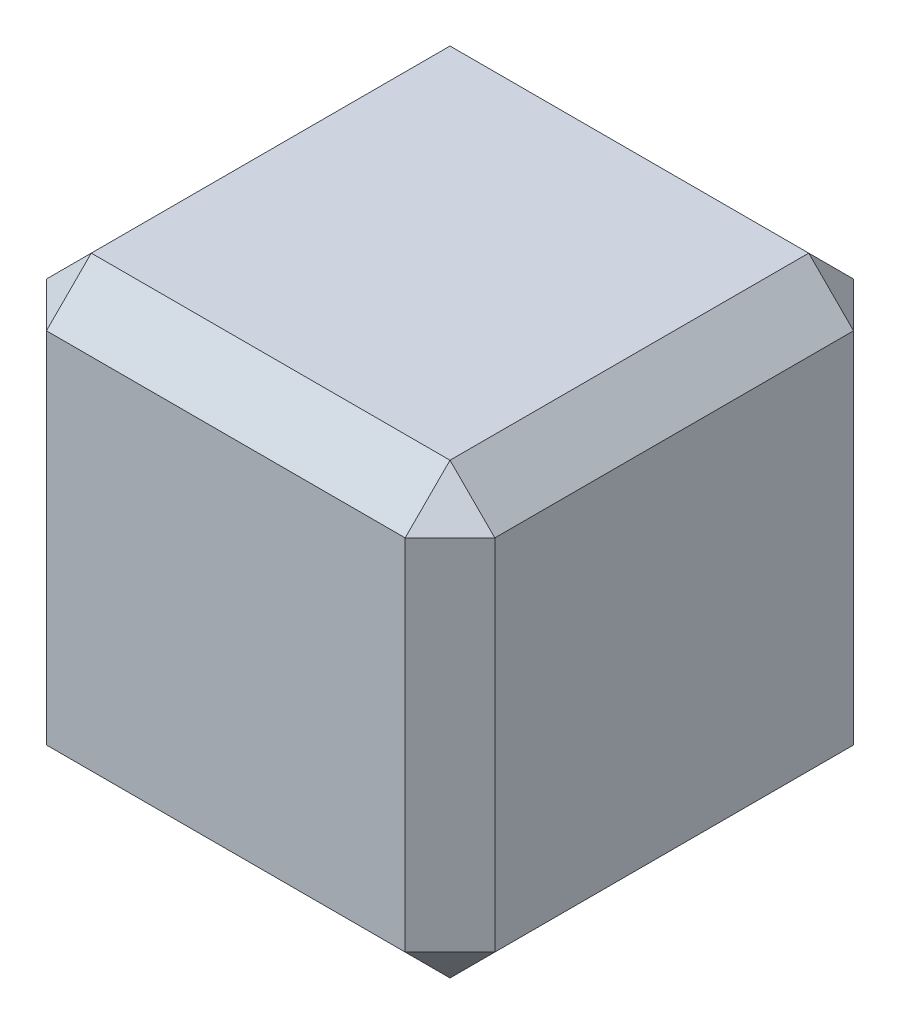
ISO-10303-21;
HEADER;
FILE_DESCRIPTION(('STEP AP214'),'2;1');
FILE_NAME('part.step','',(''),(''),'','','');
FILE_SCHEMA(('AUTOMOTIVE_DESIGN { 1 0 10303 214 1 1 1 1 }'));
ENDSEC;
DATA;
#1=APPLICATION_CONTEXT('core data for automotive mechanical design processes');
#2=APPLICATION_PROTOCOL_DEFINITION('international standard','automotive_design',2000,#1);
#3=PRODUCT_CONTEXT('',#1,'mechanical');
#4=PRODUCT('Part','Part','',(#3));
#5=PRODUCT_RELATED_PRODUCT_CATEGORY('part','',(#4));
#6=PRODUCT_DEFINITION_FORMATION('','',#4);
#7=PRODUCT_DEFINITION_CONTEXT('part definition',#1,'design');
#8=PRODUCT_DEFINITION('design','',#6,#7);
#9=PRODUCT_DEFINITION_SHAPE('','',#8);
#10=(LENGTH_UNIT() NAMED_UNIT(*) SI_UNIT(.MILLI.,.METRE.));
#11=(NAMED_UNIT(*) PLANE_ANGLE_UNIT() SI_UNIT($,.RADIAN.));
#12=(NAMED_UNIT(*) SI_UNIT($,.STERADIAN.) SOLID_ANGLE_UNIT());
#13=UNCERTAINTY_MEASURE_WITH_UNIT(LENGTH_MEASURE(1.E-05),#10,'distance_accuracy_value','');
#14=(GEOMETRIC_REPRESENTATION_CONTEXT(3) GLOBAL_UNCERTAINTY_ASSIGNED_CONTEXT((#13)) GLOBAL_UNIT_ASSIGNED_CONTEXT((#10,
#11,#12)) REPRESENTATION_CONTEXT('',''));
#15=CARTESIAN_POINT('',(0.,0.,0.));
#16=DIRECTION('',(0.,0.,1.));
#17=DIRECTION('',(1.,0.,0.));
#18=AXIS2_PLACEMENT_3D('',#15,#16,#17);
#19=CARTESIAN_POINT('',(0.,0.,10.));
#20=DIRECTION('',(1.,0.,0.));
#21=DIRECTION('',(0.,0.,-1.));
#22=AXIS2_PLACEMENT_3D('',#19,#20,#21);
#23=PLANE('',#22);
#24=DIRECTION('',(0.,0.,1.));
#25=VECTOR('',#24,1.);
#26=CARTESIAN_POINT('',(0.,0.999999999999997,10.));
#27=LINE('',#26,#25);
#28=CARTESIAN_POINT('',(0.,0.999999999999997,0.999999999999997));
#29=VERTEX_POINT('',#28);
#30=CARTESIAN_POINT('',(0.,0.999999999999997,9.));
#31=VERTEX_POINT('',#30);
#32=EDGE_CURVE('E179',#29,#31,#27,.T.);
#33=ORIENTED_EDGE('',*,*,#32,.T.);
#34=DIRECTION('',(0.,1.,0.));
#35=VECTOR('',#34,1.);
#36=CARTESIAN_POINT('',(0.,0.,9.));
#37=LINE('',#36,#35);
#38=CARTESIAN_POINT('',(0.,9.,9.));
#39=VERTEX_POINT('',#38);
#40=EDGE_CURVE('E143',#31,#39,#37,.T.);
#41=ORIENTED_EDGE('',*,*,#40,.T.);
#42=DIRECTION('',(0.,0.,-1.));
#43=VECTOR('',#42,1.);
#44=CARTESIAN_POINT('',(0.,9.,10.));
#45=LINE('',#44,#43);
#46=CARTESIAN_POINT('',(0.,9.,0.999999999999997));
#47=VERTEX_POINT('',#46);
#48=EDGE_CURVE('E181',#39,#47,#45,.T.);
#49=ORIENTED_EDGE('',*,*,#48,.T.);
#50=DIRECTION('',(0.,-1.,0.));
#51=VECTOR('',#50,1.);
#52=CARTESIAN_POINT('',(0.,0.,0.999999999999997));
#53=LINE('',#52,#51);
#54=EDGE_CURVE('E177',#47,#29,#53,.T.);
#55=ORIENTED_EDGE('',*,*,#54,.T.);
#56=EDGE_LOOP('',(#33,#41,#49,#55));
#57=FACE_BOUND('',#56,.T.);
#58=ADVANCED_FACE('F35',(#57),#23,.F.);
#59=CARTESIAN_POINT('',(0.,0.,10.));
#60=DIRECTION('',(0.,1.,0.));
#61=DIRECTION('',(0.,0.,1.));
#62=AXIS2_PLACEMENT_3D('',#59,#60,#61);
#63=PLANE('',#62);
#64=DIRECTION('',(-1.,0.,0.));
#65=VECTOR('',#64,1.);
#66=CARTESIAN_POINT('',(0.,0.,9.));
#67=LINE('',#66,#65);
#68=CARTESIAN_POINT('',(9.,0.,9.));
#69=VERTEX_POINT('',#68);
#70=CARTESIAN_POINT('',(1.,0.,9.));
#71=VERTEX_POINT('',#70);
#72=EDGE_CURVE('E197',#69,#71,#67,.T.);
#73=ORIENTED_EDGE('',*,*,#72,.T.);
#74=DIRECTION('',(0.,0.,-1.));
#75=VECTOR('',#74,1.);
#76=CARTESIAN_POINT('',(1.,0.,10.));
#77=LINE('',#76,#75);
#78=CARTESIAN_POINT('',(1.,0.,0.999999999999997));
#79=VERTEX_POINT('',#78);
#80=EDGE_CURVE('E199',#71,#79,#77,.T.);
#81=ORIENTED_EDGE('',*,*,#80,.T.);
#82=DIRECTION('',(1.,0.,0.));
#83=VECTOR('',#82,1.);
#84=CARTESIAN_POINT('',(10.,0.,0.999999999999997));
#85=LINE('',#84,#83);
#86=CARTESIAN_POINT('',(9.,0.,0.999999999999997));
#87=VERTEX_POINT('',#86);
#88=EDGE_CURVE('E193',#79,#87,#85,.T.);
#89=ORIENTED_EDGE('',*,*,#88,.T.);
#90=DIRECTION('',(0.,0.,1.));
#91=VECTOR('',#90,1.);
#92=CARTESIAN_POINT('',(9.,0.,10.));
#93=LINE('',#92,#91);
#94=EDGE_CURVE('E195',#87,#69,#93,.T.);
#95=ORIENTED_EDGE('',*,*,#94,.T.);
#96=EDGE_LOOP('',(#73,#81,#89,#95));
#97=FACE_BOUND('',#96,.T.);
#98=ADVANCED_FACE('F303',(#97),#63,.F.);
#99=CARTESIAN_POINT('',(10.,0.,10.));
#100=DIRECTION('',(-1.,0.,0.));
#101=DIRECTION('',(0.,0.,1.));
#102=AXIS2_PLACEMENT_3D('',#99,#100,#101);
#103=PLANE('',#102);
#104=DIRECTION('',(0.,0.,1.));
#105=VECTOR('',#104,1.);
#106=CARTESIAN_POINT('',(10.,9.,10.));
#107=LINE('',#106,#105);
#108=CARTESIAN_POINT('',(10.,9.,0.999999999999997));
#109=VERTEX_POINT('',#108);
#110=CARTESIAN_POINT('',(10.,9.,9.));
#111=VERTEX_POINT('',#110);
#112=EDGE_CURVE('E172',#109,#111,#107,.T.);
#113=ORIENTED_EDGE('',*,*,#112,.T.);
#114=DIRECTION('',(0.,-1.,0.));
#115=VECTOR('',#114,1.);
#116=CARTESIAN_POINT('',(10.,0.,9.));
#117=LINE('',#116,#115);
#118=CARTESIAN_POINT('',(10.,0.999999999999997,9.));
#119=VERTEX_POINT('',#118);
#120=EDGE_CURVE('E174',#111,#119,#117,.T.);
#121=ORIENTED_EDGE('',*,*,#120,.T.);
#122=DIRECTION('',(0.,0.,-1.));
#123=VECTOR('',#122,1.);
#124=CARTESIAN_POINT('',(10.,0.999999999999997,10.));
#125=LINE('',#124,#123);
#126=CARTESIAN_POINT('',(10.,0.999999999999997,0.999999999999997));
#127=VERTEX_POINT('',#126);
#128=EDGE_CURVE('E170',#119,#127,#125,.T.);
#129=ORIENTED_EDGE('',*,*,#128,.T.);
#130=DIRECTION('',(0.,1.,0.));
#131=VECTOR('',#130,1.);
#132=CARTESIAN_POINT('',(10.,10.,0.999999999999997));
#133=LINE('',#132,#131);
#134=EDGE_CURVE('E168',#127,#109,#133,.T.);
#135=ORIENTED_EDGE('',*,*,#134,.T.);
#136=EDGE_LOOP('',(#113,#121,#129,#135));
#137=FACE_BOUND('',#136,.T.);
#138=ADVANCED_FACE('F308',(#137),#103,.F.);
#139=CARTESIAN_POINT('',(0.,10.,10.));
#140=DIRECTION('',(0.,-1.,0.));
#141=DIRECTION('',(0.,0.,-1.));
#142=AXIS2_PLACEMENT_3D('',#139,#140,#141);
#143=PLANE('',#142);
#144=DIRECTION('',(1.,0.,0.));
#145=VECTOR('',#144,1.);
#146=CARTESIAN_POINT('',(0.,10.,9.));
#147=LINE('',#146,#145);
#148=CARTESIAN_POINT('',(1.,10.,9.));
#149=VERTEX_POINT('',#148);
#150=CARTESIAN_POINT('',(9.,10.,9.));
#151=VERTEX_POINT('',#150);
#152=EDGE_CURVE('E188',#149,#151,#147,.T.);
#153=ORIENTED_EDGE('',*,*,#152,.T.);
#154=DIRECTION('',(0.,0.,-1.));
#155=VECTOR('',#154,1.);
#156=CARTESIAN_POINT('',(9.,10.,10.));
#157=LINE('',#156,#155);
#158=CARTESIAN_POINT('',(9.,10.,0.999999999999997));
#159=VERTEX_POINT('',#158);
#160=EDGE_CURVE('E190',#151,#159,#157,.T.);
#161=ORIENTED_EDGE('',*,*,#160,.T.);
#162=DIRECTION('',(-1.,0.,0.));
#163=VECTOR('',#162,1.);
#164=CARTESIAN_POINT('',(0.,10.,0.999999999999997));
#165=LINE('',#164,#163);
#166=CARTESIAN_POINT('',(1.,10.,0.999999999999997));
#167=VERTEX_POINT('',#166);
#168=EDGE_CURVE('E184',#159,#167,#165,.T.);
#169=ORIENTED_EDGE('',*,*,#168,.T.);
#170=DIRECTION('',(0.,0.,1.));
#171=VECTOR('',#170,1.);
#172=CARTESIAN_POINT('',(1.,10.,10.));
#173=LINE('',#172,#171);
#174=EDGE_CURVE('E186',#167,#149,#173,.T.);
#175=ORIENTED_EDGE('',*,*,#174,.T.);
#176=EDGE_LOOP('',(#153,#161,#169,#175));
#177=FACE_BOUND('',#176,.T.);
#178=ADVANCED_FACE('F268',(#177),#143,.F.);
#179=CARTESIAN_POINT('',(0.,0.,10.));
#180=DIRECTION('',(0.,0.,-1.));
#181=DIRECTION('',(-1.,0.,0.));
#182=AXIS2_PLACEMENT_3D('',#179,#180,#181);
#183=PLANE('',#182);
#184=DIRECTION('',(0.,1.,0.));
#185=VECTOR('',#184,1.);
#186=CARTESIAN_POINT('',(9.,0.,10.));
#187=LINE('',#186,#185);
#188=CARTESIAN_POINT('',(9.,0.999999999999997,10.));
#189=VERTEX_POINT('',#188);
#190=CARTESIAN_POINT('',(9.,9.,10.));
#191=VERTEX_POINT('',#190);
#192=EDGE_CURVE('E135',#189,#191,#187,.T.);
#193=ORIENTED_EDGE('',*,*,#192,.T.);
#194=DIRECTION('',(-1.,0.,0.));
#195=VECTOR('',#194,1.);
#196=CARTESIAN_POINT('',(0.,9.,10.));
#197=LINE('',#196,#195);
#198=CARTESIAN_POINT('',(1.,9.,10.));
#199=VERTEX_POINT('',#198);
#200=EDGE_CURVE('E131',#191,#199,#197,.T.);
#201=ORIENTED_EDGE('',*,*,#200,.T.);
#202=DIRECTION('',(0.,-1.,0.));
#203=VECTOR('',#202,1.);
#204=CARTESIAN_POINT('',(1.,0.,10.));
#205=LINE('',#204,#203);
#206=CARTESIAN_POINT('',(1.,0.999999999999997,10.));
#207=VERTEX_POINT('',#206);
#208=EDGE_CURVE('E123',#199,#207,#205,.T.);
#209=ORIENTED_EDGE('',*,*,#208,.T.);
#210=DIRECTION('',(1.,0.,0.));
#211=VECTOR('',#210,1.);
#212=CARTESIAN_POINT('',(0.,0.999999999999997,10.));
#213=LINE('',#212,#211);
#214=EDGE_CURVE('E128',#207,#189,#213,.T.);
#215=ORIENTED_EDGE('',*,*,#214,.T.);
#216=EDGE_LOOP('',(#193,#201,#209,#215));
#217=FACE_BOUND('',#216,.T.);
#218=ADVANCED_FACE('F126',(#217),#183,.F.);
#219=CARTESIAN_POINT('',(0.,0.,0.));
#220=DIRECTION('',(0.,0.,-1.));
#221=DIRECTION('',(-1.,0.,0.));
#222=AXIS2_PLACEMENT_3D('',#219,#220,#221);
#223=PLANE('',#222);
#224=DIRECTION('',(0.,-1.,0.));
#225=VECTOR('',#224,1.);
#226=CARTESIAN_POINT('',(9.,0.,0.));
#227=LINE('',#226,#225);
#228=CARTESIAN_POINT('',(9.,9.,0.));
#229=VERTEX_POINT('',#228);
#230=CARTESIAN_POINT('',(9.,1.,0.));
#231=VERTEX_POINT('',#230);
#232=EDGE_CURVE('E45',#229,#231,#227,.T.);
#233=ORIENTED_EDGE('',*,*,#232,.T.);
#234=DIRECTION('',(-1.,0.,0.));
#235=VECTOR('',#234,1.);
#236=CARTESIAN_POINT('',(0.,1.,0.));
#237=LINE('',#236,#235);
#238=CARTESIAN_POINT('',(1.,1.,0.));
#239=VERTEX_POINT('',#238);
#240=EDGE_CURVE('E11',#231,#239,#237,.T.);
#241=ORIENTED_EDGE('',*,*,#240,.T.);
#242=DIRECTION('',(0.,1.,0.));
#243=VECTOR('',#242,1.);
#244=CARTESIAN_POINT('',(1.,10.,0.));
#245=LINE('',#244,#243);
#246=CARTESIAN_POINT('',(1.,9.,0.));
#247=VERTEX_POINT('',#246);
#248=EDGE_CURVE('E202',#239,#247,#245,.T.);
#249=ORIENTED_EDGE('',*,*,#248,.T.);
#250=DIRECTION('',(1.,0.,0.));
#251=VECTOR('',#250,1.);
#252=CARTESIAN_POINT('',(10.,9.,0.));
#253=LINE('',#252,#251);
#254=EDGE_CURVE('E56',#247,#229,#253,.T.);
#255=ORIENTED_EDGE('',*,*,#254,.T.);
#256=EDGE_LOOP('',(#233,#241,#249,#255));
#257=FACE_BOUND('',#256,.T.);
#258=ADVANCED_FACE('F292',(#257),#223,.T.);
#259=CARTESIAN_POINT('',(0.,0.,0.999999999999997));
#260=DIRECTION('',(-0.707106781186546,0.,-0.707106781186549));
#261=DIRECTION('',(0.,1.,0.));
#262=AXIS2_PLACEMENT_3D('',#259,#260,#261);
#263=PLANE('',#262);
#264=DIRECTION('',(0.707106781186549,0.,-0.707106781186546));
#265=VECTOR('',#264,1.);
#266=CARTESIAN_POINT('',(0.5,1.,0.499999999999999));
#267=LINE('',#266,#265);
#268=EDGE_CURVE('E40',#29,#239,#267,.T.);
#269=ORIENTED_EDGE('',*,*,#268,.F.);
#270=ORIENTED_EDGE('',*,*,#54,.F.);
#271=DIRECTION('',(-0.707106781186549,0.,0.707106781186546));
#272=VECTOR('',#271,1.);
#273=CARTESIAN_POINT('',(0.,9.,0.999999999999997));
#274=LINE('',#273,#272);
#275=EDGE_CURVE('E164',#247,#47,#274,.T.);
#276=ORIENTED_EDGE('',*,*,#275,.F.);
#277=ORIENTED_EDGE('',*,*,#248,.F.);
#278=EDGE_LOOP('',(#269,#270,#276,#277));
#279=FACE_BOUND('',#278,.T.);
#280=ADVANCED_FACE('F38',(#279),#263,.T.);
#281=CARTESIAN_POINT('',(1.,0.,0.999999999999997));
#282=DIRECTION('',(-0.577350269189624,-0.577350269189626,-0.577350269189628));
#283=DIRECTION('',(0.,0.707106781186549,-0.707106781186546));
#284=AXIS2_PLACEMENT_3D('',#281,#282,#283);
#285=PLANE('',#284);
#286=DIRECTION('',(0.707106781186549,-0.707106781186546,0.));
#287=VECTOR('',#286,1.);
#288=CARTESIAN_POINT('',(1.,0.,0.999999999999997));
#289=LINE('',#288,#287);
#290=EDGE_CURVE('E248',#29,#79,#289,.T.);
#291=ORIENTED_EDGE('',*,*,#290,.F.);
#292=ORIENTED_EDGE('',*,*,#268,.T.);
#293=DIRECTION('',(0.,-0.707106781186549,0.707106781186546));
#294=VECTOR('',#293,1.);
#295=CARTESIAN_POINT('',(1.,0.,0.999999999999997));
#296=LINE('',#295,#294);
#297=EDGE_CURVE('E251',#79,#239,#296,.F.);
#298=ORIENTED_EDGE('',*,*,#297,.F.);
#299=EDGE_LOOP('',(#291,#292,#298));
#300=FACE_BOUND('',#299,.T.);
#301=ADVANCED_FACE('F297',(#300),#285,.T.);
#302=CARTESIAN_POINT('',(0.,9.,0.999999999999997));
#303=DIRECTION('',(-0.577350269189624,0.577350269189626,-0.577350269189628));
#304=DIRECTION('',(0.,0.707106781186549,0.707106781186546));
#305=AXIS2_PLACEMENT_3D('',#302,#303,#304);
#306=PLANE('',#305);
#307=DIRECTION('',(0.,-0.707106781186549,-0.707106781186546));
#308=VECTOR('',#307,1.);
#309=CARTESIAN_POINT('',(1.,9.5,0.499999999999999));
#310=LINE('',#309,#308);
#311=EDGE_CURVE('E242',#247,#167,#310,.F.);
#312=ORIENTED_EDGE('',*,*,#311,.F.);
#313=ORIENTED_EDGE('',*,*,#275,.T.);
#314=DIRECTION('',(-0.707106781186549,-0.707106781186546,0.));
#315=VECTOR('',#314,1.);
#316=CARTESIAN_POINT('',(0.,9.,0.999999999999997));
#317=LINE('',#316,#315);
#318=EDGE_CURVE('E245',#167,#47,#317,.T.);
#319=ORIENTED_EDGE('',*,*,#318,.F.);
#320=EDGE_LOOP('',(#312,#313,#319));
#321=FACE_BOUND('',#320,.T.);
#322=ADVANCED_FACE('F257',(#321),#306,.T.);
#323=CARTESIAN_POINT('',(0.,0.,0.999999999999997));
#324=DIRECTION('',(0.,-0.707106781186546,-0.707106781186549));
#325=DIRECTION('',(-1.,0.,0.));
#326=AXIS2_PLACEMENT_3D('',#323,#324,#325);
#327=PLANE('',#326);
#328=ORIENTED_EDGE('',*,*,#297,.T.);
#329=ORIENTED_EDGE('',*,*,#240,.F.);
#330=DIRECTION('',(0.,0.707106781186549,-0.707106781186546));
#331=VECTOR('',#330,1.);
#332=CARTESIAN_POINT('',(9.,0.500000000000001,0.499999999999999));
#333=LINE('',#332,#331);
#334=EDGE_CURVE('E236',#87,#231,#333,.T.);
#335=ORIENTED_EDGE('',*,*,#334,.F.);
#336=ORIENTED_EDGE('',*,*,#88,.F.);
#337=EDGE_LOOP('',(#328,#329,#335,#336));
#338=FACE_BOUND('',#337,.T.);
#339=ADVANCED_FACE('F290',(#338),#327,.T.);
#340=CARTESIAN_POINT('',(1.,0.,10.));
#341=DIRECTION('',(0.707106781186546,0.707106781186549,0.));
#342=DIRECTION('',(0.,0.,-1.));
#343=AXIS2_PLACEMENT_3D('',#340,#341,#342);
#344=PLANE('',#343);
#345=ORIENTED_EDGE('',*,*,#290,.T.);
#346=ORIENTED_EDGE('',*,*,#80,.F.);
#347=DIRECTION('',(-0.707106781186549,0.707106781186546,0.));
#348=VECTOR('',#347,1.);
#349=CARTESIAN_POINT('',(0.5,0.499999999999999,9.));
#350=LINE('',#349,#348);
#351=EDGE_CURVE('E147',#31,#71,#350,.F.);
#352=ORIENTED_EDGE('',*,*,#351,.F.);
#353=ORIENTED_EDGE('',*,*,#32,.F.);
#354=EDGE_LOOP('',(#345,#346,#352,#353));
#355=FACE_BOUND('',#354,.T.);
#356=ADVANCED_FACE('F300',(#355),#344,.F.);
#357=CARTESIAN_POINT('',(1.,0.,10.));
#358=DIRECTION('',(0.707106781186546,0.,-0.707106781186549));
#359=DIRECTION('',(0.,-1.,0.));
#360=AXIS2_PLACEMENT_3D('',#357,#358,#359);
#361=PLANE('',#360);
#362=DIRECTION('',(-0.707106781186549,0.,-0.707106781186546));
#363=VECTOR('',#362,1.);
#364=CARTESIAN_POINT('',(0.,9.,9.));
#365=LINE('',#364,#363);
#366=EDGE_CURVE('E148',#39,#199,#365,.F.);
#367=ORIENTED_EDGE('',*,*,#366,.F.);
#368=ORIENTED_EDGE('',*,*,#40,.F.);
#369=DIRECTION('',(0.707106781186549,0.,0.707106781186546));
#370=VECTOR('',#369,1.);
#371=CARTESIAN_POINT('',(1.,0.999999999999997,10.));
#372=LINE('',#371,#370);
#373=EDGE_CURVE('E139',#207,#31,#372,.F.);
#374=ORIENTED_EDGE('',*,*,#373,.F.);
#375=ORIENTED_EDGE('',*,*,#208,.F.);
#376=EDGE_LOOP('',(#367,#368,#374,#375));
#377=FACE_BOUND('',#376,.T.);
#378=ADVANCED_FACE('F141',(#377),#361,.F.);
#379=CARTESIAN_POINT('',(0.,9.,10.));
#380=DIRECTION('',(0.707106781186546,-0.707106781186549,0.));
#381=DIRECTION('',(0.,0.,-1.));
#382=AXIS2_PLACEMENT_3D('',#379,#380,#381);
#383=PLANE('',#382);
#384=ORIENTED_EDGE('',*,*,#318,.T.);
#385=ORIENTED_EDGE('',*,*,#48,.F.);
#386=DIRECTION('',(0.707106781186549,0.707106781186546,0.));
#387=VECTOR('',#386,1.);
#388=CARTESIAN_POINT('',(0.,9.,9.));
#389=LINE('',#388,#387);
#390=EDGE_CURVE('E232',#149,#39,#389,.F.);
#391=ORIENTED_EDGE('',*,*,#390,.F.);
#392=ORIENTED_EDGE('',*,*,#174,.F.);
#393=EDGE_LOOP('',(#384,#385,#391,#392));
#394=FACE_BOUND('',#393,.T.);
#395=ADVANCED_FACE('F264',(#394),#383,.F.);
#396=CARTESIAN_POINT('',(0.,10.,0.999999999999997));
#397=DIRECTION('',(0.,0.707106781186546,-0.707106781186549));
#398=DIRECTION('',(1.,0.,0.));
#399=AXIS2_PLACEMENT_3D('',#396,#397,#398);
#400=PLANE('',#399);
#401=ORIENTED_EDGE('',*,*,#311,.T.);
#402=ORIENTED_EDGE('',*,*,#168,.F.);
#403=DIRECTION('',(0.,0.707106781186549,0.707106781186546));
#404=VECTOR('',#403,1.);
#405=CARTESIAN_POINT('',(9.,10.,0.999999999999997));
#406=LINE('',#405,#404);
#407=EDGE_CURVE('E229',#229,#159,#406,.T.);
#408=ORIENTED_EDGE('',*,*,#407,.F.);
#409=ORIENTED_EDGE('',*,*,#254,.F.);
#410=EDGE_LOOP('',(#401,#402,#408,#409));
#411=FACE_BOUND('',#410,.T.);
#412=ADVANCED_FACE('F274',(#411),#400,.T.);
#413=CARTESIAN_POINT('',(10.,0.,0.999999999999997));
#414=DIRECTION('',(0.707106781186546,0.,-0.707106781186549));
#415=DIRECTION('',(0.,-1.,0.));
#416=AXIS2_PLACEMENT_3D('',#413,#414,#415);
#417=PLANE('',#416);
#418=DIRECTION('',(0.707106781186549,0.,0.707106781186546));
#419=VECTOR('',#418,1.);
#420=CARTESIAN_POINT('',(10.,0.999999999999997,0.999999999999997));
#421=LINE('',#420,#419);
#422=EDGE_CURVE('E239',#231,#127,#421,.T.);
#423=ORIENTED_EDGE('',*,*,#422,.F.);
#424=ORIENTED_EDGE('',*,*,#232,.F.);
#425=DIRECTION('',(-0.707106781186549,0.,-0.707106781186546));
#426=VECTOR('',#425,1.);
#427=CARTESIAN_POINT('',(9.5,9.,0.499999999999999));
#428=LINE('',#427,#426);
#429=EDGE_CURVE('E226',#109,#229,#428,.T.);
#430=ORIENTED_EDGE('',*,*,#429,.F.);
#431=ORIENTED_EDGE('',*,*,#134,.F.);
#432=EDGE_LOOP('',(#423,#424,#430,#431));
#433=FACE_BOUND('',#432,.T.);
#434=ADVANCED_FACE('F283',(#433),#417,.T.);
#435=CARTESIAN_POINT('',(10.,0.999999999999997,0.999999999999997));
#436=DIRECTION('',(0.577350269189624,-0.577350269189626,-0.577350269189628));
#437=DIRECTION('',(0.,0.707106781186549,-0.707106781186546));
#438=AXIS2_PLACEMENT_3D('',#435,#436,#437);
#439=PLANE('',#438);
#440=ORIENTED_EDGE('',*,*,#334,.T.);
#441=ORIENTED_EDGE('',*,*,#422,.T.);
#442=DIRECTION('',(0.707106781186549,0.707106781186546,0.));
#443=VECTOR('',#442,1.);
#444=CARTESIAN_POINT('',(10.,0.999999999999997,0.999999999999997));
#445=LINE('',#444,#443);
#446=EDGE_CURVE('E155',#87,#127,#445,.T.);
#447=ORIENTED_EDGE('',*,*,#446,.F.);
#448=EDGE_LOOP('',(#440,#441,#447));
#449=FACE_BOUND('',#448,.T.);
#450=ADVANCED_FACE('F287',(#449),#439,.T.);
#451=CARTESIAN_POINT('',(1.,0.999999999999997,10.));
#452=DIRECTION('',(-0.577350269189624,-0.577350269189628,0.577350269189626));
#453=DIRECTION('',(0.,-0.707106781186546,-0.707106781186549));
#454=AXIS2_PLACEMENT_3D('',#451,#452,#453);
#455=PLANE('',#454);
#456=ORIENTED_EDGE('',*,*,#373,.T.);
#457=ORIENTED_EDGE('',*,*,#351,.T.);
#458=DIRECTION('',(0.,-0.707106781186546,-0.707106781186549));
#459=VECTOR('',#458,1.);
#460=CARTESIAN_POINT('',(1.,0.999999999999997,10.));
#461=LINE('',#460,#459);
#462=EDGE_CURVE('E151',#207,#71,#461,.T.);
#463=ORIENTED_EDGE('',*,*,#462,.F.);
#464=EDGE_LOOP('',(#456,#457,#463));
#465=FACE_BOUND('',#464,.T.);
#466=ADVANCED_FACE('F152',(#465),#455,.T.);
#467=CARTESIAN_POINT('',(0.,9.,9.));
#468=DIRECTION('',(-0.577350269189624,0.577350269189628,0.577350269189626));
#469=DIRECTION('',(0.,-0.707106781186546,0.707106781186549));
#470=AXIS2_PLACEMENT_3D('',#467,#468,#469);
#471=PLANE('',#470);
#472=ORIENTED_EDGE('',*,*,#390,.T.);
#473=ORIENTED_EDGE('',*,*,#366,.T.);
#474=DIRECTION('',(0.,-0.707106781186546,0.707106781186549));
#475=VECTOR('',#474,1.);
#476=CARTESIAN_POINT('',(1.,9.5,9.5));
#477=LINE('',#476,#475);
#478=EDGE_CURVE('E156',#149,#199,#477,.T.);
#479=ORIENTED_EDGE('',*,*,#478,.F.);
#480=EDGE_LOOP('',(#472,#473,#479));
#481=FACE_BOUND('',#480,.T.);
#482=ADVANCED_FACE('F366',(#481),#471,.T.);
#483=CARTESIAN_POINT('',(9.,10.,0.999999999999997));
#484=DIRECTION('',(0.577350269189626,0.577350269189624,-0.577350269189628));
#485=DIRECTION('',(-0.707106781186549,0.,-0.707106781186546));
#486=AXIS2_PLACEMENT_3D('',#483,#484,#485);
#487=PLANE('',#486);
#488=ORIENTED_EDGE('',*,*,#429,.T.);
#489=ORIENTED_EDGE('',*,*,#407,.T.);
#490=DIRECTION('',(-0.707106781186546,0.707106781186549,0.));
#491=VECTOR('',#490,1.);
#492=CARTESIAN_POINT('',(9.,10.,0.999999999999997));
#493=LINE('',#492,#491);
#494=EDGE_CURVE('E220',#109,#159,#493,.T.);
#495=ORIENTED_EDGE('',*,*,#494,.F.);
#496=EDGE_LOOP('',(#488,#489,#495));
#497=FACE_BOUND('',#496,.T.);
#498=ADVANCED_FACE('F278',(#497),#487,.T.);
#499=CARTESIAN_POINT('',(10.,0.999999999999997,10.));
#500=DIRECTION('',(-0.707106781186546,0.707106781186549,0.));
#501=DIRECTION('',(0.,0.,-1.));
#502=AXIS2_PLACEMENT_3D('',#499,#500,#501);
#503=PLANE('',#502);
#504=ORIENTED_EDGE('',*,*,#446,.T.);
#505=ORIENTED_EDGE('',*,*,#128,.F.);
#506=DIRECTION('',(-0.707106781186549,-0.707106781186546,0.));
#507=VECTOR('',#506,1.);
#508=CARTESIAN_POINT('',(10.,0.999999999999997,9.));
#509=LINE('',#508,#507);
#510=EDGE_CURVE('E217',#69,#119,#509,.F.);
#511=ORIENTED_EDGE('',*,*,#510,.F.);
#512=ORIENTED_EDGE('',*,*,#94,.F.);
#513=EDGE_LOOP('',(#504,#505,#511,#512));
#514=FACE_BOUND('',#513,.T.);
#515=ADVANCED_FACE('F354',(#514),#503,.F.);
#516=CARTESIAN_POINT('',(0.,0.999999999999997,10.));
#517=DIRECTION('',(0.,0.707106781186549,-0.707106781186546));
#518=DIRECTION('',(1.,0.,0.));
#519=AXIS2_PLACEMENT_3D('',#516,#517,#518);
#520=PLANE('',#519);
#521=ORIENTED_EDGE('',*,*,#462,.T.);
#522=ORIENTED_EDGE('',*,*,#72,.F.);
#523=DIRECTION('',(0.,0.707106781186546,0.707106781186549));
#524=VECTOR('',#523,1.);
#525=CARTESIAN_POINT('',(9.,0.499999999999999,9.5));
#526=LINE('',#525,#524);
#527=EDGE_CURVE('E160',#189,#69,#526,.F.);
#528=ORIENTED_EDGE('',*,*,#527,.F.);
#529=ORIENTED_EDGE('',*,*,#214,.F.);
#530=EDGE_LOOP('',(#521,#522,#528,#529));
#531=FACE_BOUND('',#530,.T.);
#532=ADVANCED_FACE('F158',(#531),#520,.F.);
#533=CARTESIAN_POINT('',(0.,9.,10.));
#534=DIRECTION('',(0.,-0.707106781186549,-0.707106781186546));
#535=DIRECTION('',(-1.,0.,0.));
#536=AXIS2_PLACEMENT_3D('',#533,#534,#535);
#537=PLANE('',#536);
#538=ORIENTED_EDGE('',*,*,#478,.T.);
#539=ORIENTED_EDGE('',*,*,#200,.F.);
#540=DIRECTION('',(0.,0.707106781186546,-0.707106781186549));
#541=VECTOR('',#540,1.);
#542=CARTESIAN_POINT('',(9.,9.,10.));
#543=LINE('',#542,#541);
#544=EDGE_CURVE('E213',#151,#191,#543,.F.);
#545=ORIENTED_EDGE('',*,*,#544,.F.);
#546=ORIENTED_EDGE('',*,*,#152,.F.);
#547=EDGE_LOOP('',(#538,#539,#545,#546));
#548=FACE_BOUND('',#547,.T.);
#549=ADVANCED_FACE('F341',(#548),#537,.F.);
#550=CARTESIAN_POINT('',(9.,10.,10.));
#551=DIRECTION('',(-0.707106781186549,-0.707106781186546,0.));
#552=DIRECTION('',(0.,0.,-1.));
#553=AXIS2_PLACEMENT_3D('',#550,#551,#552);
#554=PLANE('',#553);
#555=ORIENTED_EDGE('',*,*,#494,.T.);
#556=ORIENTED_EDGE('',*,*,#160,.F.);
#557=DIRECTION('',(0.707106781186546,-0.707106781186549,0.));
#558=VECTOR('',#557,1.);
#559=CARTESIAN_POINT('',(9.5,9.5,9.));
#560=LINE('',#559,#558);
#561=EDGE_CURVE('E210',#111,#151,#560,.F.);
#562=ORIENTED_EDGE('',*,*,#561,.F.);
#563=ORIENTED_EDGE('',*,*,#112,.F.);
#564=EDGE_LOOP('',(#555,#556,#562,#563));
#565=FACE_BOUND('',#564,.T.);
#566=ADVANCED_FACE('F334',(#565),#554,.F.);
#567=CARTESIAN_POINT('',(10.,0.999999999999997,9.));
#568=DIRECTION('',(0.577350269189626,-0.577350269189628,0.577350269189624));
#569=DIRECTION('',(0.707106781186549,0.707106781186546,0.));
#570=AXIS2_PLACEMENT_3D('',#567,#568,#569);
#571=PLANE('',#570);
#572=ORIENTED_EDGE('',*,*,#527,.T.);
#573=ORIENTED_EDGE('',*,*,#510,.T.);
#574=DIRECTION('',(0.707106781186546,0.,-0.707106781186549));
#575=VECTOR('',#574,1.);
#576=CARTESIAN_POINT('',(10.,0.999999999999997,9.));
#577=LINE('',#576,#575);
#578=EDGE_CURVE('E208',#189,#119,#577,.T.);
#579=ORIENTED_EDGE('',*,*,#578,.F.);
#580=EDGE_LOOP('',(#572,#573,#579));
#581=FACE_BOUND('',#580,.T.);
#582=ADVANCED_FACE('F327',(#581),#571,.T.);
#583=CARTESIAN_POINT('',(9.,9.,10.));
#584=DIRECTION('',(0.577350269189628,0.577350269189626,0.577350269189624));
#585=DIRECTION('',(-0.707106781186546,0.707106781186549,0.));
#586=AXIS2_PLACEMENT_3D('',#583,#584,#585);
#587=PLANE('',#586);
#588=ORIENTED_EDGE('',*,*,#561,.T.);
#589=ORIENTED_EDGE('',*,*,#544,.T.);
#590=DIRECTION('',(-0.707106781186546,0.,0.707106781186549));
#591=VECTOR('',#590,1.);
#592=CARTESIAN_POINT('',(9.,9.,10.));
#593=LINE('',#592,#591);
#594=EDGE_CURVE('E206',#111,#191,#593,.T.);
#595=ORIENTED_EDGE('',*,*,#594,.F.);
#596=EDGE_LOOP('',(#588,#589,#595));
#597=FACE_BOUND('',#596,.T.);
#598=ADVANCED_FACE('F320',(#597),#587,.T.);
#599=CARTESIAN_POINT('',(9.,0.,10.));
#600=DIRECTION('',(-0.707106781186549,0.,-0.707106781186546));
#601=DIRECTION('',(0.,1.,0.));
#602=AXIS2_PLACEMENT_3D('',#599,#600,#601);
#603=PLANE('',#602);
#604=ORIENTED_EDGE('',*,*,#578,.T.);
#605=ORIENTED_EDGE('',*,*,#120,.F.);
#606=ORIENTED_EDGE('',*,*,#594,.T.);
#607=ORIENTED_EDGE('',*,*,#192,.F.);
#608=EDGE_LOOP('',(#604,#605,#606,#607));
#609=FACE_BOUND('',#608,.T.);
#610=ADVANCED_FACE('F314',(#609),#603,.F.);
#611=CLOSED_SHELL('',(#58,#98,#138,#178,#218,#258,#280,#301,#322,#339,#356,#378,#395,#412,#434,
#450,#466,#482,#498,#515,#532,#549,#566,#582,#598,#610));
#612=MANIFOLD_SOLID_BREP('B2',#611);
#613=ADVANCED_BREP_SHAPE_REPRESENTATION('',(#18,#612),#14);
#614=SHAPE_DEFINITION_REPRESENTATION(#9,#613);
ENDSEC;
END-ISO-10303-21;
